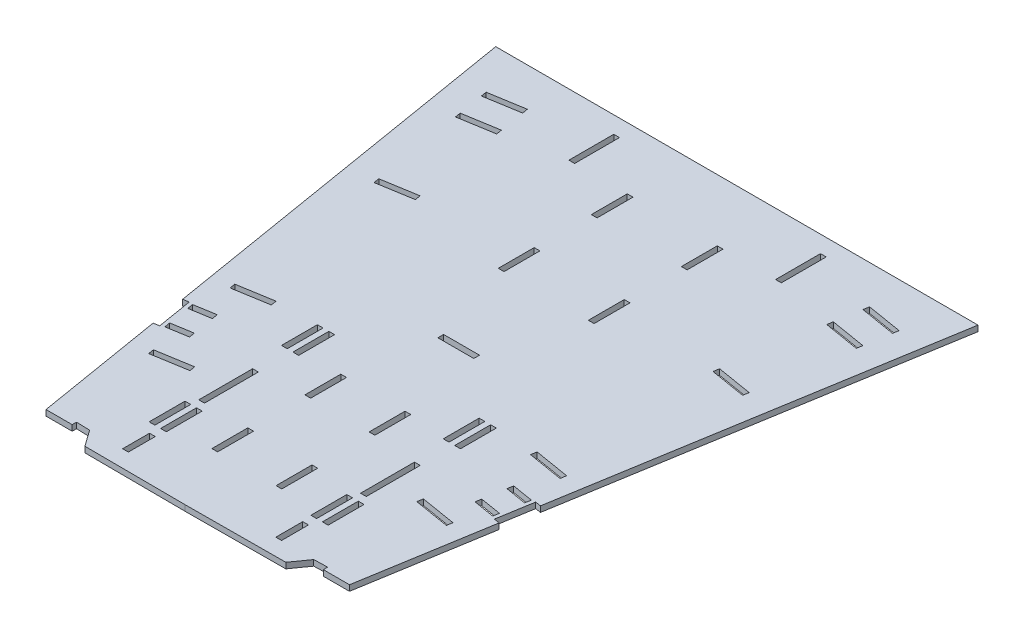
from build123d import *

# Parameters (mm, degrees)
SKETCH1_W           = 1.524
SKETCH1_H           = 9.525
SKETCH1_H_2         = 14.311129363
SKETCH1_H_3         = 11.90625
SKETCH1_H_4         = 7.14375
BOSS_EXTRUDE1_DEPTH = 1.524
CUT_EXTRUDE1_DEPTH  = 1.524
SKETCH3_W           = 9.525
SKETCH3_H           = 1.524
CUT_EXTRUDE2_DEPTH  = 1.524


with BuildPart() as part:
    # Sketch1 → Boss-Extrude1 (new body)
    with BuildSketch(Plane(origin=(0, 0, 0), x_dir=(1, 0, 0), z_dir=(0, 1, 0))):
        Polygon((42.661628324, 122.833243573), (-85.323256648, 122.833243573), (-68.80717285, 23.223939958), (-67.303699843, 23.473228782), (-65.745644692, 14.076522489), (-67.249117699, 13.827233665), (-61.600051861, -20.242556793), (-54.647574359, -20.242556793), (-54.647574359, -19.089775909), (-51.063275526, -19.202650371), (-47.99977122, -23.521234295), (-21.330814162, -23.657816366), (5.338142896, -23.521234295), (8.401647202, -19.202650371), (11.985946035, -19.089775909), (11.985946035, -20.242556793), (18.938423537, -20.242556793), (24.587489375, 13.827233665), (23.084016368, 14.076522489), (24.642071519, 23.473228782), (26.145544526, 23.223939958), align=None)
        with Locations((-33.277780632, 101.685626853)):
            Rectangle(SKETCH1_W, SKETCH1_H, mode=Mode.SUBTRACT)
        with Locations((-9.383847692, 76.99487939)):
            Rectangle(SKETCH1_W, SKETCH1_H, mode=Mode.SUBTRACT)
        with Locations((-9.383847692, 101.685626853)):
            Rectangle(SKETCH1_W, SKETCH1_H, mode=Mode.SUBTRACT)
        with Locations((-33.277780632, 76.99487939)):
            Rectangle(SKETCH1_W, SKETCH1_H, mode=Mode.SUBTRACT)
        with Locations((-29.848412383, 22.242877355)):
            Rectangle(SKETCH1_W, SKETCH1_H, mode=Mode.SUBTRACT)
        with Locations((-29.848412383, -2.447870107)):
            Rectangle(SKETCH1_W, SKETCH1_H, mode=Mode.SUBTRACT)
        with Locations((-12.813215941, -2.447870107)):
            Rectangle(SKETCH1_W, SKETCH1_H, mode=Mode.SUBTRACT)
        with Locations((-12.813215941, 22.242877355)):
            Rectangle(SKETCH1_W, SKETCH1_H, mode=Mode.SUBTRACT)
        with Locations((-44.322805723, 30.492976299)):
            Rectangle(SKETCH1_W, SKETCH1_H, mode=Mode.SUBTRACT)
        with Locations((-42.798805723, 9.407865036)):
            Rectangle(SKETCH1_W, SKETCH1_H_2, mode=Mode.SUBTRACT)
        with Locations((-1.386822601, 30.492976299)):
            Rectangle(SKETCH1_W, SKETCH1_H, mode=Mode.SUBTRACT)
        with Locations((1.661177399, 30.492976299)):
            Rectangle(SKETCH1_W, SKETCH1_H, mode=Mode.SUBTRACT)
        with Locations((0.137177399, 9.407865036)):
            Rectangle(SKETCH1_W, SKETCH1_H_2, mode=Mode.SUBTRACT)
        with Locations((-41.274805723, 30.492976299)):
            Rectangle(SKETCH1_W, SKETCH1_H, mode=Mode.SUBTRACT)
        with Locations((1.661177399, -4.629871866)):
            Rectangle(SKETCH1_W, SKETCH1_H, mode=Mode.SUBTRACT)
        Polygon((-65.369463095, 104.393528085), (-65.120174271, 102.890055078), (-74.516880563, 101.331999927), (-74.766169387, 102.835472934), align=None, mode=Mode.SUBTRACT)
        Polygon((-61.078152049, 78.51242273), (-60.828863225, 77.008949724), (-70.225569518, 75.450894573), (-70.474858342, 76.95436758), align=None, mode=Mode.SUBTRACT)
        Polygon((27.813230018, 76.95436758), (18.416523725, 78.51242273), (18.167234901, 77.008949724), (27.563941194, 75.450894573), align=None, mode=Mode.SUBTRACT)
        Polygon((32.104541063, 102.835472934), (22.707834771, 104.393528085), (22.458545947, 102.890055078), (31.855252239, 101.331999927), align=None, mode=Mode.SUBTRACT)
        Polygon((18.416523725, 7.742282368), (9.019817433, 9.300337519), (8.770528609, 7.796864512), (18.167234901, 6.238809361), align=None, mode=Mode.SUBTRACT)
        Polygon((22.707834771, 33.623387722), (13.311128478, 35.181442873), (13.061839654, 33.677969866), (22.458545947, 32.119914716), align=None, mode=Mode.SUBTRACT)
        Polygon((-65.369463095, 33.623387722), (-65.120174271, 32.119914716), (-55.723467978, 33.677969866), (-55.972756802, 35.181442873), align=None, mode=Mode.SUBTRACT)
        Polygon((-51.681445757, 9.300337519), (-51.432156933, 7.796864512), (-60.828863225, 6.238809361), (-61.078152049, 7.742282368), align=None, mode=Mode.SUBTRACT)
        with Locations((-48.76177122, 112.401251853)):
            Rectangle(SKETCH1_W, SKETCH1_H_3, mode=Mode.SUBTRACT)
        with Locations((6.100142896, 112.401251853)):
            Rectangle(SKETCH1_W, SKETCH1_H_3, mode=Mode.SUBTRACT)
        with Locations((-41.655805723, -15.517900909)):
            Rectangle(SKETCH1_W, SKETCH1_H_4, mode=Mode.SUBTRACT)
        with Locations((-1.005822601, -15.517900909)):
            Rectangle(SKETCH1_W, SKETCH1_H_4, mode=Mode.SUBTRACT)
        Polygon((23.826591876, 111.140806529), (24.0758807, 112.644279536), (33.472586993, 111.086224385), (33.223298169, 109.582751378), align=None, mode=Mode.SUBTRACT)
        Polygon((-75.884926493, 109.582751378), (-66.4882202, 111.140806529), (-66.737509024, 112.644279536), (-76.134215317, 111.086224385), align=None, mode=Mode.SUBTRACT)
        with Locations((-1.386822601, -4.629871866)):
            Rectangle(SKETCH1_W, SKETCH1_H, mode=Mode.SUBTRACT)
        with Locations((-41.274805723, -4.629871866)):
            Rectangle(SKETCH1_W, SKETCH1_H, mode=Mode.SUBTRACT)
        with Locations((-44.322805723, -4.629871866)):
            Rectangle(SKETCH1_W, SKETCH1_H, mode=Mode.SUBTRACT)
    extrude(amount=BOSS_EXTRUDE1_DEPTH)

    # Sketch2 → Cut-Extrude1 (cut)
    with BuildSketch(Plane.XZ):
        Polygon((22.415658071, -16.068998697), (16.807944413, -16.998806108), (16.552593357, -15.466309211), (22.160915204, -14.536400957), align=None)
        Polygon((17.758705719, -22.732893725), (18.011624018, -24.265793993), (23.619945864, -23.335885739), (23.366419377, -21.803086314), align=None)
        Polygon((-66.028047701, -21.803086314), (-60.420334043, -22.732893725), (-60.673252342, -24.265793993), (-66.281574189, -23.335885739), align=None)
        Polygon((-59.469572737, -16.998806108), (-59.214221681, -15.466309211), (-64.822543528, -14.536400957), (-65.077286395, -16.068998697), align=None)
    extrude(amount=-CUT_EXTRUDE1_DEPTH, mode=Mode.SUBTRACT)

    # Sketch3 → Cut-Extrude2 (cut)
    with BuildSketch(Plane.XZ):
        with Locations((-21.330814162, -49.007487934)):
            Rectangle(SKETCH3_W, SKETCH3_H)
    extrude(amount=-CUT_EXTRUDE2_DEPTH, mode=Mode.SUBTRACT)


solid = part.part
